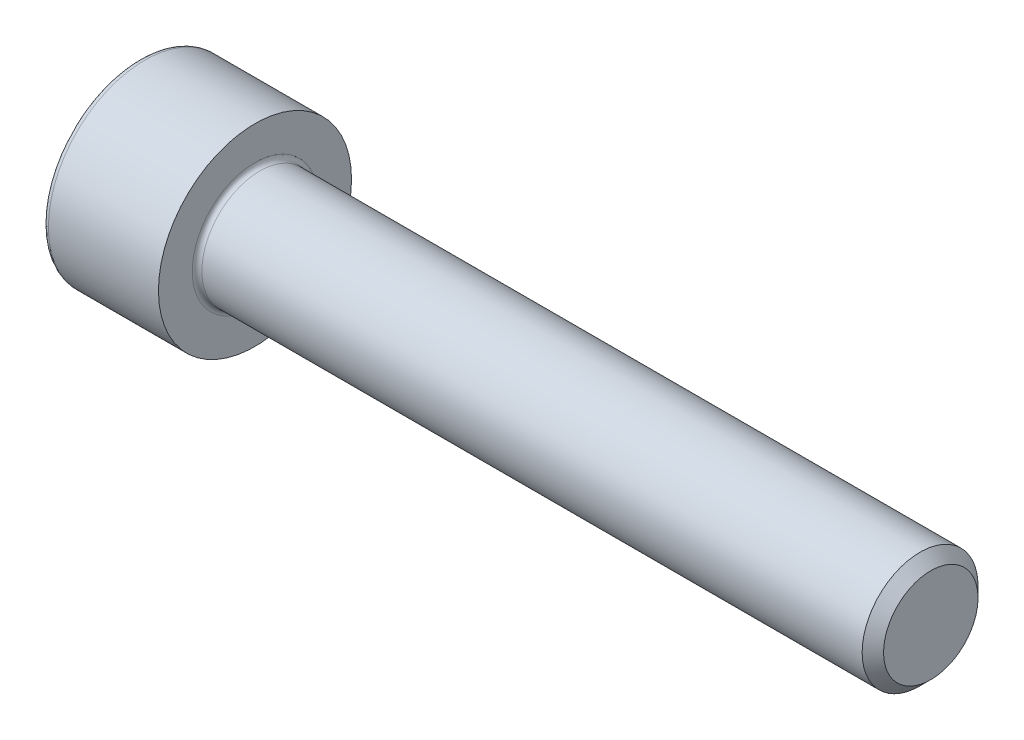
ISO-10303-21;
HEADER;
FILE_DESCRIPTION(('STEP AP214'),'2;1');
FILE_NAME('part.step','',(''),(''),'','','');
FILE_SCHEMA(('AUTOMOTIVE_DESIGN { 1 0 10303 214 1 1 1 1 }'));
ENDSEC;
DATA;
#1=APPLICATION_CONTEXT('core data for automotive mechanical design processes');
#2=APPLICATION_PROTOCOL_DEFINITION('international standard','automotive_design',2000,#1);
#3=PRODUCT_CONTEXT('',#1,'mechanical');
#4=PRODUCT('Part','Part','',(#3));
#5=PRODUCT_RELATED_PRODUCT_CATEGORY('part','',(#4));
#6=PRODUCT_DEFINITION_FORMATION('','',#4);
#7=PRODUCT_DEFINITION_CONTEXT('part definition',#1,'design');
#8=PRODUCT_DEFINITION('design','',#6,#7);
#9=PRODUCT_DEFINITION_SHAPE('','',#8);
#10=(LENGTH_UNIT() NAMED_UNIT(*) SI_UNIT(.MILLI.,.METRE.));
#11=(NAMED_UNIT(*) PLANE_ANGLE_UNIT() SI_UNIT($,.RADIAN.));
#12=(NAMED_UNIT(*) SI_UNIT($,.STERADIAN.) SOLID_ANGLE_UNIT());
#13=UNCERTAINTY_MEASURE_WITH_UNIT(LENGTH_MEASURE(1.E-05),#10,'distance_accuracy_value','');
#14=(GEOMETRIC_REPRESENTATION_CONTEXT(3) GLOBAL_UNCERTAINTY_ASSIGNED_CONTEXT((#13)) GLOBAL_UNIT_ASSIGNED_CONTEXT((#10,
#11,#12)) REPRESENTATION_CONTEXT('',''));
#15=CARTESIAN_POINT('',(0.,0.,0.));
#16=DIRECTION('',(0.,0.,1.));
#17=DIRECTION('',(1.,0.,0.));
#18=AXIS2_PLACEMENT_3D('',#15,#16,#17);
#19=CARTESIAN_POINT('',(0.,0.,0.));
#20=DIRECTION('',(-1.,0.,0.));
#21=DIRECTION('',(0.,0.,1.));
#22=AXIS2_PLACEMENT_3D('',#19,#20,#21);
#23=PLANE('',#22);
#24=DIRECTION('',(0.,-0.499999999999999,0.866025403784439));
#25=VECTOR('',#24,1.);
#26=CARTESIAN_POINT('',(0.,2.93524876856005,0.));
#27=LINE('',#26,#25);
#28=CARTESIAN_POINT('',(0.,2.93524876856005,0.));
#29=VERTEX_POINT('',#28);
#30=CARTESIAN_POINT('',(0.,1.46762438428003,2.542));
#31=VERTEX_POINT('',#30);
#32=EDGE_CURVE('E254',#29,#31,#27,.T.);
#33=ORIENTED_EDGE('',*,*,#32,.T.);
#34=DIRECTION('',(0.,1.,0.));
#35=VECTOR('',#34,1.);
#36=CARTESIAN_POINT('',(0.,-1.46762438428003,2.542));
#37=LINE('',#36,#35);
#38=CARTESIAN_POINT('',(0.,-1.46762438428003,2.542));
#39=VERTEX_POINT('',#38);
#40=EDGE_CURVE('E126',#39,#31,#37,.T.);
#41=ORIENTED_EDGE('',*,*,#40,.F.);
#42=DIRECTION('',(0.,-0.500000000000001,-0.866025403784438));
#43=VECTOR('',#42,1.);
#44=CARTESIAN_POINT('',(0.,-1.46762438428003,2.542));
#45=LINE('',#44,#43);
#46=CARTESIAN_POINT('',(0.,-2.93524876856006,0.));
#47=VERTEX_POINT('',#46);
#48=EDGE_CURVE('E257',#39,#47,#45,.T.);
#49=ORIENTED_EDGE('',*,*,#48,.T.);
#50=DIRECTION('',(0.,0.499999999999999,-0.866025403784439));
#51=VECTOR('',#50,1.);
#52=CARTESIAN_POINT('',(0.,-2.93524876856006,0.));
#53=LINE('',#52,#51);
#54=CARTESIAN_POINT('',(0.,-1.46762438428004,-2.542));
#55=VERTEX_POINT('',#54);
#56=EDGE_CURVE('E260',#47,#55,#53,.T.);
#57=ORIENTED_EDGE('',*,*,#56,.T.);
#58=DIRECTION('',(0.,-1.,0.));
#59=VECTOR('',#58,1.);
#60=CARTESIAN_POINT('',(0.,1.46762438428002,-2.542));
#61=LINE('',#60,#59);
#62=CARTESIAN_POINT('',(0.,1.46762438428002,-2.542));
#63=VERTEX_POINT('',#62);
#64=EDGE_CURVE('E263',#63,#55,#61,.T.);
#65=ORIENTED_EDGE('',*,*,#64,.F.);
#66=DIRECTION('',(0.,-0.500000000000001,-0.866025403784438));
#67=VECTOR('',#66,1.);
#68=CARTESIAN_POINT('',(0.,2.93524876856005,0.));
#69=LINE('',#68,#67);
#70=EDGE_CURVE('E121',#29,#63,#69,.T.);
#71=ORIENTED_EDGE('',*,*,#70,.F.);
#72=EDGE_LOOP('',(#33,#41,#49,#57,#65,#71));
#73=FACE_BOUND('',#72,.T.);
#74=CARTESIAN_POINT('',(0.,0.,0.));
#75=DIRECTION('',(-1.,0.,0.));
#76=DIRECTION('',(0.,0.,1.));
#77=AXIS2_PLACEMENT_3D('',#74,#75,#76);
#78=CIRCLE('',#77,4.7);
#79=CARTESIAN_POINT('',(0.,0.,4.7));
#80=VERTEX_POINT('',#79);
#81=EDGE_CURVE('E38',#80,#80,#78,.T.);
#82=ORIENTED_EDGE('',*,*,#81,.T.);
#83=EDGE_LOOP('',(#82));
#84=FACE_BOUND('',#83,.T.);
#85=ADVANCED_FACE('F30',(#73,#84),#23,.T.);
#86=CARTESIAN_POINT('',(-31.75,0.,0.));
#87=DIRECTION('',(-1.,0.,0.));
#88=DIRECTION('',(0.,0.,1.));
#89=AXIS2_PLACEMENT_3D('',#86,#87,#88);
#90=CYLINDRICAL_SURFACE('',#89,5.);
#91=CARTESIAN_POINT('',(0.300000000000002,0.,0.));
#92=DIRECTION('',(-1.,0.,0.));
#93=DIRECTION('',(0.,0.,1.));
#94=AXIS2_PLACEMENT_3D('',#91,#92,#93);
#95=CIRCLE('',#94,5.);
#96=CARTESIAN_POINT('',(0.300000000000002,0.,5.));
#97=VERTEX_POINT('',#96);
#98=EDGE_CURVE('E11',#97,#97,#95,.F.);
#99=ORIENTED_EDGE('',*,*,#98,.T.);
#100=EDGE_LOOP('',(#99));
#101=FACE_BOUND('',#100,.T.);
#102=CARTESIAN_POINT('',(6.,0.,0.));
#103=DIRECTION('',(-1.,0.,0.));
#104=DIRECTION('',(0.,0.,1.));
#105=AXIS2_PLACEMENT_3D('',#102,#103,#104);
#106=CIRCLE('',#105,5.);
#107=CARTESIAN_POINT('',(6.,0.,5.));
#108=VERTEX_POINT('',#107);
#109=EDGE_CURVE('E144',#108,#108,#106,.T.);
#110=ORIENTED_EDGE('',*,*,#109,.T.);
#111=EDGE_LOOP('',(#110));
#112=FACE_BOUND('',#111,.T.);
#113=ADVANCED_FACE('F168',(#101,#112),#90,.T.);
#114=CARTESIAN_POINT('',(6.,5.,0.));
#115=DIRECTION('',(1.,0.,0.));
#116=DIRECTION('',(0.,0.,-1.));
#117=AXIS2_PLACEMENT_3D('',#114,#115,#116);
#118=PLANE('',#117);
#119=CARTESIAN_POINT('',(6.,0.,0.));
#120=DIRECTION('',(1.,0.,0.));
#121=DIRECTION('',(0.,0.,-1.));
#122=AXIS2_PLACEMENT_3D('',#119,#120,#121);
#123=CIRCLE('',#122,3.24999999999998);
#124=CARTESIAN_POINT('',(6.,0.,-3.24999999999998));
#125=VERTEX_POINT('',#124);
#126=EDGE_CURVE('E147',#125,#125,#123,.F.);
#127=ORIENTED_EDGE('',*,*,#126,.T.);
#128=EDGE_LOOP('',(#127));
#129=FACE_BOUND('',#128,.T.);
#130=ORIENTED_EDGE('',*,*,#109,.F.);
#131=EDGE_LOOP('',(#130));
#132=FACE_BOUND('',#131,.T.);
#133=ADVANCED_FACE('F174',(#129,#132),#118,.T.);
#134=CARTESIAN_POINT('',(-31.75,0.,0.));
#135=DIRECTION('',(-1.,0.,0.));
#136=DIRECTION('',(0.,0.,1.));
#137=AXIS2_PLACEMENT_3D('',#134,#135,#136);
#138=CYLINDRICAL_SURFACE('',#137,2.99999999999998);
#139=CARTESIAN_POINT('',(6.25,0.,0.));
#140=DIRECTION('',(1.,0.,0.));
#141=DIRECTION('',(0.,0.,-1.));
#142=AXIS2_PLACEMENT_3D('',#139,#140,#141);
#143=CIRCLE('',#142,2.99999999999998);
#144=CARTESIAN_POINT('',(6.25,0.,-2.99999999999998));
#145=VERTEX_POINT('',#144);
#146=EDGE_CURVE('E150',#145,#145,#143,.T.);
#147=ORIENTED_EDGE('',*,*,#146,.T.);
#148=EDGE_LOOP('',(#147));
#149=FACE_BOUND('',#148,.T.);
#150=CARTESIAN_POINT('',(40.4455,0.,0.));
#151=DIRECTION('',(-1.,0.,0.));
#152=DIRECTION('',(0.,0.,1.));
#153=AXIS2_PLACEMENT_3D('',#150,#151,#152);
#154=CIRCLE('',#153,2.99999999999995);
#155=CARTESIAN_POINT('',(40.4455,0.,2.99999999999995));
#156=VERTEX_POINT('',#155);
#157=EDGE_CURVE('E141',#156,#156,#154,.T.);
#158=ORIENTED_EDGE('',*,*,#157,.T.);
#159=EDGE_LOOP('',(#158));
#160=FACE_BOUND('',#159,.T.);
#161=ADVANCED_FACE('F180',(#149,#160),#138,.T.);
#162=CARTESIAN_POINT('',(41.,0.,0.));
#163=DIRECTION('',(-1.,0.,0.));
#164=DIRECTION('',(0.,0.,1.));
#165=AXIS2_PLACEMENT_3D('',#162,#163,#164);
#166=CONICAL_SURFACE('',#165,2.4455,0.78539816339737);
#167=ORIENTED_EDGE('',*,*,#157,.F.);
#168=EDGE_LOOP('',(#167));
#169=FACE_BOUND('',#168,.T.);
#170=CARTESIAN_POINT('',(41.,0.,0.));
#171=DIRECTION('',(-1.,0.,0.));
#172=DIRECTION('',(0.,0.,1.));
#173=AXIS2_PLACEMENT_3D('',#170,#171,#172);
#174=CIRCLE('',#173,2.4455);
#175=CARTESIAN_POINT('',(41.,0.,2.4455));
#176=VERTEX_POINT('',#175);
#177=EDGE_CURVE('E137',#176,#176,#174,.T.);
#178=ORIENTED_EDGE('',*,*,#177,.T.);
#179=EDGE_LOOP('',(#178));
#180=FACE_BOUND('',#179,.T.);
#181=ADVANCED_FACE('F184',(#169,#180),#166,.T.);
#182=CARTESIAN_POINT('',(41.,2.4455,0.));
#183=DIRECTION('',(1.,0.,0.));
#184=DIRECTION('',(0.,0.,-1.));
#185=AXIS2_PLACEMENT_3D('',#182,#183,#184);
#186=PLANE('',#185);
#187=ORIENTED_EDGE('',*,*,#177,.F.);
#188=EDGE_LOOP('',(#187));
#189=FACE_BOUND('',#188,.T.);
#190=ADVANCED_FACE('F164',(#189),#186,.T.);
#191=CARTESIAN_POINT('',(6.25,0.,0.));
#192=DIRECTION('',(1.,0.,0.));
#193=DIRECTION('',(0.,0.,-1.));
#194=AXIS2_PLACEMENT_3D('',#191,#192,#193);
#195=TOROIDAL_SURFACE('',#194,3.24999999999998,0.25);
#196=ORIENTED_EDGE('',*,*,#146,.F.);
#197=EDGE_LOOP('',(#196));
#198=FACE_BOUND('',#197,.T.);
#199=ORIENTED_EDGE('',*,*,#126,.F.);
#200=EDGE_LOOP('',(#199));
#201=FACE_BOUND('',#200,.T.);
#202=ADVANCED_FACE('F157',(#198,#201),#195,.F.);
#203=CARTESIAN_POINT('',(0.300000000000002,0.,0.));
#204=DIRECTION('',(-1.,0.,0.));
#205=DIRECTION('',(0.,0.,1.));
#206=AXIS2_PLACEMENT_3D('',#203,#204,#205);
#207=TOROIDAL_SURFACE('',#206,4.7,0.3);
#208=ORIENTED_EDGE('',*,*,#98,.F.);
#209=EDGE_LOOP('',(#208));
#210=FACE_BOUND('',#209,.T.);
#211=ORIENTED_EDGE('',*,*,#81,.F.);
#212=EDGE_LOOP('',(#211));
#213=FACE_BOUND('',#212,.T.);
#214=ADVANCED_FACE('F32',(#210,#213),#207,.T.);
#215=CARTESIAN_POINT('',(3.,2.93524876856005,0.));
#216=DIRECTION('',(0.,-0.866025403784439,-0.499999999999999));
#217=DIRECTION('',(0.,0.499999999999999,-0.866025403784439));
#218=AXIS2_PLACEMENT_3D('',#215,#216,#217);
#219=PLANE('',#218);
#220=ORIENTED_EDGE('',*,*,#32,.F.);
#221=DIRECTION('',(-1.,0.,0.));
#222=VECTOR('',#221,1.);
#223=CARTESIAN_POINT('',(3.,2.93524876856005,0.));
#224=LINE('',#223,#222);
#225=CARTESIAN_POINT('',(3.,2.93524876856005,0.));
#226=VERTEX_POINT('',#225);
#227=EDGE_CURVE('E244',#226,#29,#224,.T.);
#228=ORIENTED_EDGE('',*,*,#227,.F.);
#229=DIRECTION('',(0.,-0.499999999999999,0.866025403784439));
#230=VECTOR('',#229,1.);
#231=CARTESIAN_POINT('',(3.,2.93524876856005,0.));
#232=LINE('',#231,#230);
#233=CARTESIAN_POINT('',(3.,2.20143657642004,1.271));
#234=VERTEX_POINT('',#233);
#235=EDGE_CURVE('E113',#226,#234,#232,.T.);
#236=ORIENTED_EDGE('',*,*,#235,.T.);
#237=CARTESIAN_POINT('',(3.,1.46762438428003,2.542));
#238=VERTEX_POINT('',#237);
#239=EDGE_CURVE('E104',#234,#238,#232,.T.);
#240=ORIENTED_EDGE('',*,*,#239,.T.);
#241=DIRECTION('',(-1.,0.,0.));
#242=VECTOR('',#241,1.);
#243=CARTESIAN_POINT('',(3.,1.46762438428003,2.542));
#244=LINE('',#243,#242);
#245=EDGE_CURVE('E118',#238,#31,#244,.T.);
#246=ORIENTED_EDGE('',*,*,#245,.T.);
#247=EDGE_LOOP('',(#220,#228,#236,#240,#246));
#248=FACE_BOUND('',#247,.T.);
#249=ADVANCED_FACE('F117',(#248),#219,.T.);
#250=CARTESIAN_POINT('',(3.,-1.46762438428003,2.542));
#251=DIRECTION('',(0.,0.,1.));
#252=DIRECTION('',(0.,-1.,0.));
#253=AXIS2_PLACEMENT_3D('',#250,#251,#252);
#254=PLANE('',#253);
#255=ORIENTED_EDGE('',*,*,#40,.T.);
#256=ORIENTED_EDGE('',*,*,#245,.F.);
#257=DIRECTION('',(0.,1.,0.));
#258=VECTOR('',#257,1.);
#259=CARTESIAN_POINT('',(3.,-1.46762438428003,2.542));
#260=LINE('',#259,#258);
#261=CARTESIAN_POINT('',(3.,0.,2.542));
#262=VERTEX_POINT('',#261);
#263=EDGE_CURVE('E101',#262,#238,#260,.T.);
#264=ORIENTED_EDGE('',*,*,#263,.F.);
#265=CARTESIAN_POINT('',(3.,-1.46762438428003,2.542));
#266=VERTEX_POINT('',#265);
#267=EDGE_CURVE('E112',#266,#262,#260,.T.);
#268=ORIENTED_EDGE('',*,*,#267,.F.);
#269=DIRECTION('',(-1.,0.,0.));
#270=VECTOR('',#269,1.);
#271=CARTESIAN_POINT('',(3.,-1.46762438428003,2.542));
#272=LINE('',#271,#270);
#273=EDGE_CURVE('E128',#266,#39,#272,.T.);
#274=ORIENTED_EDGE('',*,*,#273,.T.);
#275=EDGE_LOOP('',(#255,#256,#264,#268,#274));
#276=FACE_BOUND('',#275,.T.);
#277=ADVANCED_FACE('F123',(#276),#254,.F.);
#278=CARTESIAN_POINT('',(3.,-1.46762438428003,2.542));
#279=DIRECTION('',(0.,0.866025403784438,-0.500000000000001));
#280=DIRECTION('',(0.,0.500000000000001,0.866025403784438));
#281=AXIS2_PLACEMENT_3D('',#278,#279,#280);
#282=PLANE('',#281);
#283=ORIENTED_EDGE('',*,*,#48,.F.);
#284=ORIENTED_EDGE('',*,*,#273,.F.);
#285=DIRECTION('',(0.,-0.500000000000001,-0.866025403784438));
#286=VECTOR('',#285,1.);
#287=CARTESIAN_POINT('',(3.,-1.46762438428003,2.542));
#288=LINE('',#287,#286);
#289=CARTESIAN_POINT('',(3.,-2.20143657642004,1.271));
#290=VERTEX_POINT('',#289);
#291=EDGE_CURVE('E283',#266,#290,#288,.T.);
#292=ORIENTED_EDGE('',*,*,#291,.T.);
#293=CARTESIAN_POINT('',(3.,-2.93524876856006,0.));
#294=VERTEX_POINT('',#293);
#295=EDGE_CURVE('E272',#290,#294,#288,.T.);
#296=ORIENTED_EDGE('',*,*,#295,.T.);
#297=DIRECTION('',(-1.,0.,0.));
#298=VECTOR('',#297,1.);
#299=CARTESIAN_POINT('',(3.,-2.93524876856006,0.));
#300=LINE('',#299,#298);
#301=EDGE_CURVE('E133',#294,#47,#300,.T.);
#302=ORIENTED_EDGE('',*,*,#301,.T.);
#303=EDGE_LOOP('',(#283,#284,#292,#296,#302));
#304=FACE_BOUND('',#303,.T.);
#305=ADVANCED_FACE('F198',(#304),#282,.T.);
#306=CARTESIAN_POINT('',(3.,-2.93524876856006,0.));
#307=DIRECTION('',(0.,0.866025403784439,0.499999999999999));
#308=DIRECTION('',(0.,-0.499999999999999,0.866025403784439));
#309=AXIS2_PLACEMENT_3D('',#306,#307,#308);
#310=PLANE('',#309);
#311=ORIENTED_EDGE('',*,*,#56,.F.);
#312=ORIENTED_EDGE('',*,*,#301,.F.);
#313=DIRECTION('',(0.,0.499999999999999,-0.866025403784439));
#314=VECTOR('',#313,1.);
#315=CARTESIAN_POINT('',(3.,-2.93524876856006,0.));
#316=LINE('',#315,#314);
#317=CARTESIAN_POINT('',(3.,-2.20143657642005,-1.271));
#318=VERTEX_POINT('',#317);
#319=EDGE_CURVE('E250',#294,#318,#316,.T.);
#320=ORIENTED_EDGE('',*,*,#319,.T.);
#321=CARTESIAN_POINT('',(3.,-1.46762438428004,-2.542));
#322=VERTEX_POINT('',#321);
#323=EDGE_CURVE('E282',#318,#322,#316,.T.);
#324=ORIENTED_EDGE('',*,*,#323,.T.);
#325=DIRECTION('',(-1.,0.,0.));
#326=VECTOR('',#325,1.);
#327=CARTESIAN_POINT('',(3.,-1.46762438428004,-2.542));
#328=LINE('',#327,#326);
#329=EDGE_CURVE('E243',#322,#55,#328,.T.);
#330=ORIENTED_EDGE('',*,*,#329,.T.);
#331=EDGE_LOOP('',(#311,#312,#320,#324,#330));
#332=FACE_BOUND('',#331,.T.);
#333=ADVANCED_FACE('F201',(#332),#310,.T.);
#334=CARTESIAN_POINT('',(3.,1.46762438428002,-2.542));
#335=DIRECTION('',(0.,0.,-1.));
#336=DIRECTION('',(0.,1.,0.));
#337=AXIS2_PLACEMENT_3D('',#334,#335,#336);
#338=PLANE('',#337);
#339=ORIENTED_EDGE('',*,*,#64,.T.);
#340=ORIENTED_EDGE('',*,*,#329,.F.);
#341=DIRECTION('',(0.,-1.,0.));
#342=VECTOR('',#341,1.);
#343=CARTESIAN_POINT('',(3.,1.46762438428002,-2.542));
#344=LINE('',#343,#342);
#345=CARTESIAN_POINT('',(3.,0.,-2.542));
#346=VERTEX_POINT('',#345);
#347=EDGE_CURVE('E247',#346,#322,#344,.T.);
#348=ORIENTED_EDGE('',*,*,#347,.F.);
#349=CARTESIAN_POINT('',(3.,1.46762438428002,-2.542));
#350=VERTEX_POINT('',#349);
#351=EDGE_CURVE('E45',#350,#346,#344,.T.);
#352=ORIENTED_EDGE('',*,*,#351,.F.);
#353=DIRECTION('',(-1.,0.,0.));
#354=VECTOR('',#353,1.);
#355=CARTESIAN_POINT('',(3.,1.46762438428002,-2.542));
#356=LINE('',#355,#354);
#357=EDGE_CURVE('E240',#350,#63,#356,.T.);
#358=ORIENTED_EDGE('',*,*,#357,.T.);
#359=EDGE_LOOP('',(#339,#340,#348,#352,#358));
#360=FACE_BOUND('',#359,.T.);
#361=ADVANCED_FACE('F205',(#360),#338,.F.);
#362=CARTESIAN_POINT('',(3.,2.93524876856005,0.));
#363=DIRECTION('',(0.,0.866025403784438,-0.500000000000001));
#364=DIRECTION('',(0.,0.500000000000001,0.866025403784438));
#365=AXIS2_PLACEMENT_3D('',#362,#363,#364);
#366=PLANE('',#365);
#367=ORIENTED_EDGE('',*,*,#70,.T.);
#368=ORIENTED_EDGE('',*,*,#357,.F.);
#369=DIRECTION('',(0.,-0.500000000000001,-0.866025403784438));
#370=VECTOR('',#369,1.);
#371=CARTESIAN_POINT('',(3.,2.93524876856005,0.));
#372=LINE('',#371,#370);
#373=CARTESIAN_POINT('',(3.,2.20143657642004,-1.271));
#374=VERTEX_POINT('',#373);
#375=EDGE_CURVE('E230',#374,#350,#372,.T.);
#376=ORIENTED_EDGE('',*,*,#375,.F.);
#377=EDGE_CURVE('E236',#226,#374,#372,.T.);
#378=ORIENTED_EDGE('',*,*,#377,.F.);
#379=ORIENTED_EDGE('',*,*,#227,.T.);
#380=EDGE_LOOP('',(#367,#368,#376,#378,#379));
#381=FACE_BOUND('',#380,.T.);
#382=ADVANCED_FACE('F209',(#381),#366,.F.);
#383=CARTESIAN_POINT('',(3.,2.93524876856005,0.));
#384=DIRECTION('',(1.,0.,0.));
#385=DIRECTION('',(0.,0.,-1.));
#386=AXIS2_PLACEMENT_3D('',#383,#384,#385);
#387=PLANE('',#386);
#388=ORIENTED_EDGE('',*,*,#347,.T.);
#389=ORIENTED_EDGE('',*,*,#323,.F.);
#390=CARTESIAN_POINT('',(3.,0.,0.));
#391=DIRECTION('',(-1.,0.,0.));
#392=DIRECTION('',(0.,0.,1.));
#393=AXIS2_PLACEMENT_3D('',#390,#391,#392);
#394=CIRCLE('',#393,2.542);
#395=EDGE_CURVE('E278',#346,#318,#394,.T.);
#396=ORIENTED_EDGE('',*,*,#395,.F.);
#397=EDGE_LOOP('',(#388,#389,#396));
#398=FACE_BOUND('',#397,.T.);
#399=ADVANCED_FACE('F213',(#398),#387,.F.);
#400=ORIENTED_EDGE('',*,*,#319,.F.);
#401=ORIENTED_EDGE('',*,*,#295,.F.);
#402=EDGE_CURVE('E131',#318,#290,#394,.T.);
#403=ORIENTED_EDGE('',*,*,#402,.F.);
#404=EDGE_LOOP('',(#400,#401,#403));
#405=FACE_BOUND('',#404,.T.);
#406=ADVANCED_FACE('F216',(#405),#387,.F.);
#407=ORIENTED_EDGE('',*,*,#291,.F.);
#408=ORIENTED_EDGE('',*,*,#267,.T.);
#409=EDGE_CURVE('E127',#290,#262,#394,.T.);
#410=ORIENTED_EDGE('',*,*,#409,.F.);
#411=EDGE_LOOP('',(#407,#408,#410));
#412=FACE_BOUND('',#411,.T.);
#413=ADVANCED_FACE('F221',(#412),#387,.F.);
#414=ORIENTED_EDGE('',*,*,#263,.T.);
#415=ORIENTED_EDGE('',*,*,#239,.F.);
#416=EDGE_CURVE('E107',#262,#234,#394,.T.);
#417=ORIENTED_EDGE('',*,*,#416,.F.);
#418=EDGE_LOOP('',(#414,#415,#417));
#419=FACE_BOUND('',#418,.T.);
#420=ADVANCED_FACE('F103',(#419),#387,.F.);
#421=ORIENTED_EDGE('',*,*,#235,.F.);
#422=ORIENTED_EDGE('',*,*,#377,.T.);
#423=EDGE_CURVE('E138',#234,#374,#394,.T.);
#424=ORIENTED_EDGE('',*,*,#423,.F.);
#425=EDGE_LOOP('',(#421,#422,#424));
#426=FACE_BOUND('',#425,.T.);
#427=ADVANCED_FACE('F224',(#426),#387,.F.);
#428=ORIENTED_EDGE('',*,*,#375,.T.);
#429=ORIENTED_EDGE('',*,*,#351,.T.);
#430=EDGE_CURVE('E233',#374,#346,#394,.T.);
#431=ORIENTED_EDGE('',*,*,#430,.F.);
#432=EDGE_LOOP('',(#428,#429,#431));
#433=FACE_BOUND('',#432,.T.);
#434=ADVANCED_FACE('F194',(#433),#387,.F.);
#435=CARTESIAN_POINT('',(3.,0.,0.));
#436=DIRECTION('',(-1.,0.,0.));
#437=DIRECTION('',(0.,0.,1.));
#438=AXIS2_PLACEMENT_3D('',#435,#436,#437);
#439=CONICAL_SURFACE('',#438,2.542,1.04719755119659);
#440=CARTESIAN_POINT('',(4.46762438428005,0.,0.));
#441=VERTEX_POINT('',#440);
#442=VERTEX_LOOP('',#441);
#443=FACE_BOUND('',#442,.T.);
#444=ORIENTED_EDGE('',*,*,#416,.T.);
#445=ORIENTED_EDGE('',*,*,#423,.T.);
#446=ORIENTED_EDGE('',*,*,#430,.T.);
#447=ORIENTED_EDGE('',*,*,#395,.T.);
#448=ORIENTED_EDGE('',*,*,#402,.T.);
#449=ORIENTED_EDGE('',*,*,#409,.T.);
#450=EDGE_LOOP('',(#444,#445,#446,#447,#448,#449));
#451=FACE_BOUND('',#450,.T.);
#452=ADVANCED_FACE('F192',(#443,#451),#439,.F.);
#453=CLOSED_SHELL('',(#85,#113,#133,#161,#181,#190,#202,#214,#249,#277,#305,#333,#361,#382,#399,
#406,#413,#420,#427,#434,#452));
#454=MANIFOLD_SOLID_BREP('B2',#453);
#455=ADVANCED_BREP_SHAPE_REPRESENTATION('',(#18,#454),#14);
#456=SHAPE_DEFINITION_REPRESENTATION(#9,#455);
ENDSEC;
END-ISO-10303-21;
